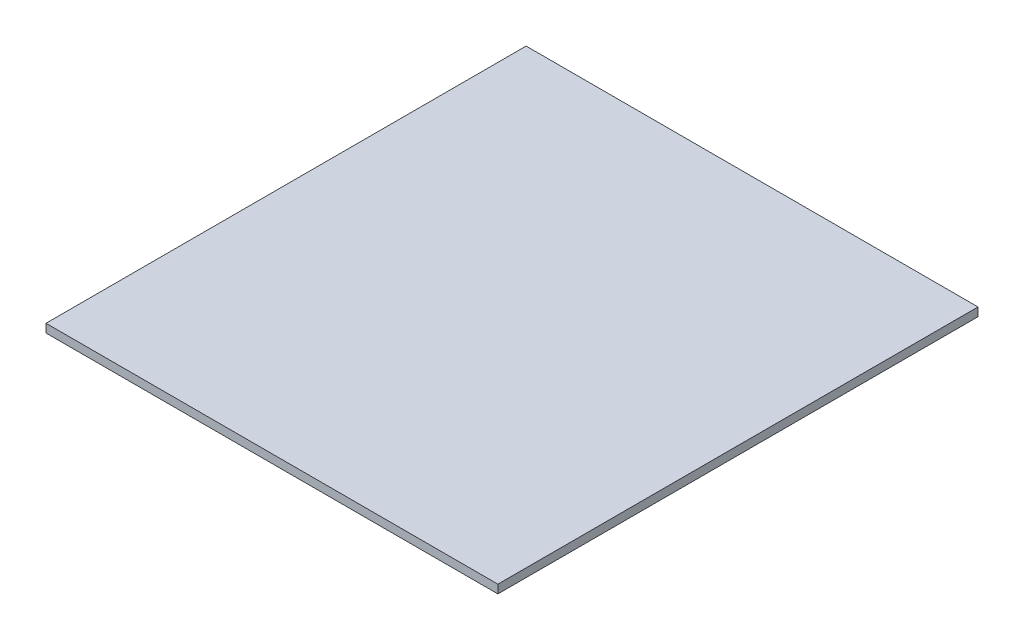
from build123d import *

# Parameters (mm, degrees)
SKETCH1_W           = 640
SKETCH1_H           = 680
BOSS_EXTRUDE1_DEPTH = 12


with BuildPart() as part:
    # Sketch1 → Boss-Extrude1 (new body)
    with BuildSketch(Plane(origin=(0, 0, 0), x_dir=(1, 0, 0), z_dir=(0, 1, 0))):
        Rectangle(SKETCH1_W, SKETCH1_H)
    extrude(amount=BOSS_EXTRUDE1_DEPTH)


solid = part.part
